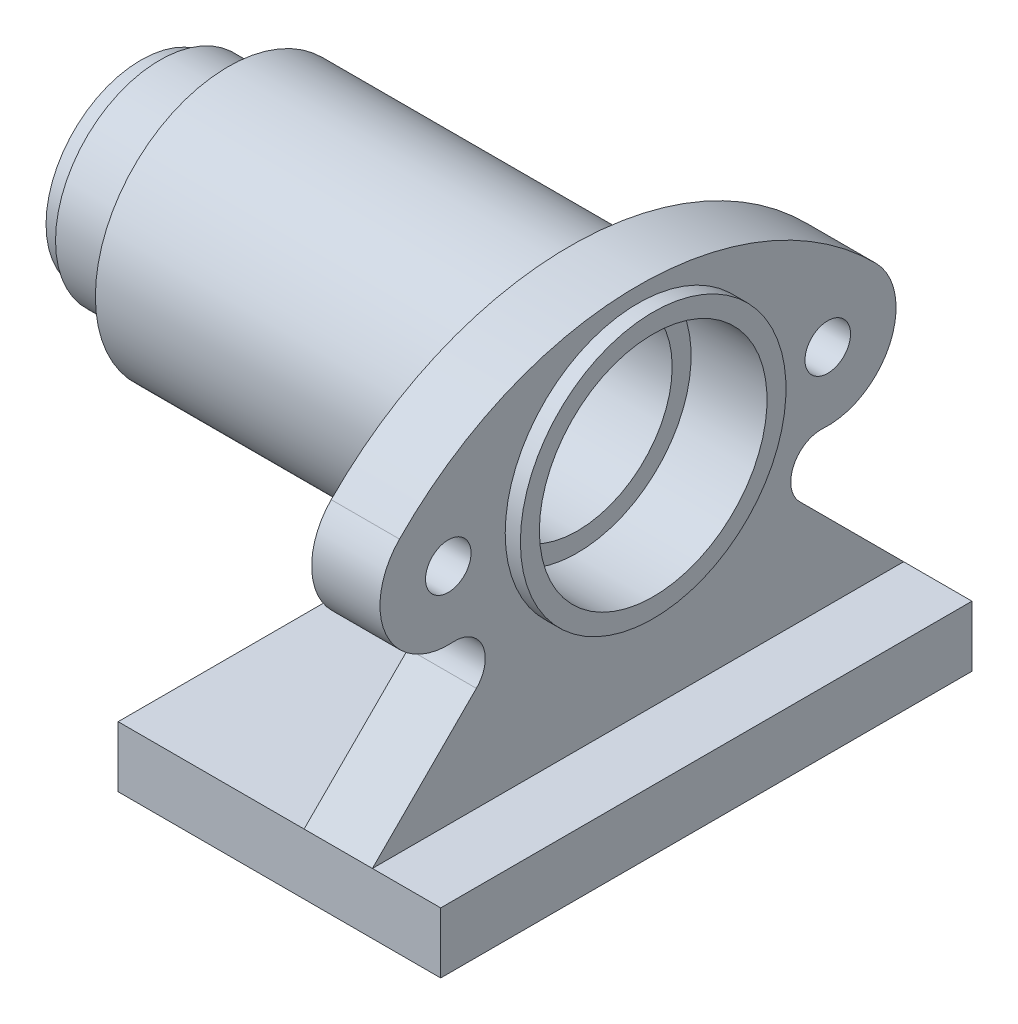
ISO-10303-21;
HEADER;
FILE_DESCRIPTION(('STEP AP214'),'2;1');
FILE_NAME('part.step','',(''),(''),'','','');
FILE_SCHEMA(('AUTOMOTIVE_DESIGN { 1 0 10303 214 1 1 1 1 }'));
ENDSEC;
DATA;
#1=APPLICATION_CONTEXT('core data for automotive mechanical design processes');
#2=APPLICATION_PROTOCOL_DEFINITION('international standard','automotive_design',2000,#1);
#3=PRODUCT_CONTEXT('',#1,'mechanical');
#4=PRODUCT('Part','Part','',(#3));
#5=PRODUCT_RELATED_PRODUCT_CATEGORY('part','',(#4));
#6=PRODUCT_DEFINITION_FORMATION('','',#4);
#7=PRODUCT_DEFINITION_CONTEXT('part definition',#1,'design');
#8=PRODUCT_DEFINITION('design','',#6,#7);
#9=PRODUCT_DEFINITION_SHAPE('','',#8);
#10=(LENGTH_UNIT() NAMED_UNIT(*) SI_UNIT(.MILLI.,.METRE.));
#11=(NAMED_UNIT(*) PLANE_ANGLE_UNIT() SI_UNIT($,.RADIAN.));
#12=(NAMED_UNIT(*) SI_UNIT($,.STERADIAN.) SOLID_ANGLE_UNIT());
#13=UNCERTAINTY_MEASURE_WITH_UNIT(LENGTH_MEASURE(1.E-05),#10,'distance_accuracy_value','');
#14=(GEOMETRIC_REPRESENTATION_CONTEXT(3) GLOBAL_UNCERTAINTY_ASSIGNED_CONTEXT((#13)) GLOBAL_UNIT_ASSIGNED_CONTEXT((#10,
#11,#12)) REPRESENTATION_CONTEXT('',''));
#15=CARTESIAN_POINT('',(0.,0.,0.));
#16=DIRECTION('',(0.,0.,1.));
#17=DIRECTION('',(1.,0.,0.));
#18=AXIS2_PLACEMENT_3D('',#15,#16,#17);
#19=CARTESIAN_POINT('',(0.,16.,70.));
#20=DIRECTION('',(0.,-1.,0.));
#21=DIRECTION('',(1.,0.,0.));
#22=AXIS2_PLACEMENT_3D('',#19,#20,#21);
#23=PLANE('',#22);
#24=DIRECTION('',(0.,0.,-1.));
#25=VECTOR('',#24,1.);
#26=CARTESIAN_POINT('',(-18.,16.,70.));
#27=LINE('',#26,#25);
#28=CARTESIAN_POINT('',(-18.,16.,70.));
#29=VERTEX_POINT('',#28);
#30=CARTESIAN_POINT('',(-18.,16.,-70.));
#31=VERTEX_POINT('',#30);
#32=EDGE_CURVE('E177',#29,#31,#27,.T.);
#33=ORIENTED_EDGE('',*,*,#32,.F.);
#34=DIRECTION('',(-1.,0.,0.));
#35=VECTOR('',#34,1.);
#36=CARTESIAN_POINT('',(0.,16.,70.));
#37=LINE('',#36,#35);
#38=CARTESIAN_POINT('',(0.,16.,70.));
#39=VERTEX_POINT('',#38);
#40=EDGE_CURVE('E218',#39,#29,#37,.T.);
#41=ORIENTED_EDGE('',*,*,#40,.F.);
#42=DIRECTION('',(0.,0.,-1.));
#43=VECTOR('',#42,1.);
#44=CARTESIAN_POINT('',(0.,16.,70.));
#45=LINE('',#44,#43);
#46=CARTESIAN_POINT('',(0.,16.,-70.));
#47=VERTEX_POINT('',#46);
#48=EDGE_CURVE('E42',#39,#47,#45,.T.);
#49=ORIENTED_EDGE('',*,*,#48,.T.);
#50=DIRECTION('',(-1.,0.,0.));
#51=VECTOR('',#50,1.);
#52=CARTESIAN_POINT('',(0.,16.,-70.));
#53=LINE('',#52,#51);
#54=EDGE_CURVE('E224',#47,#31,#53,.T.);
#55=ORIENTED_EDGE('',*,*,#54,.T.);
#56=EDGE_LOOP('',(#33,#41,#49,#55));
#57=FACE_BOUND('',#56,.T.);
#58=ADVANCED_FACE('F33',(#57),#23,.F.);
#59=CARTESIAN_POINT('',(-85.,0.,70.));
#60=DIRECTION('',(0.,1.,0.));
#61=DIRECTION('',(-1.,0.,0.));
#62=AXIS2_PLACEMENT_3D('',#59,#60,#61);
#63=PLANE('',#62);
#64=DIRECTION('',(1.,0.,0.));
#65=VECTOR('',#64,1.);
#66=CARTESIAN_POINT('',(-85.,0.,-70.));
#67=LINE('',#66,#65);
#68=CARTESIAN_POINT('',(-85.,0.,-70.));
#69=VERTEX_POINT('',#68);
#70=CARTESIAN_POINT('',(0.,0.,-70.));
#71=VERTEX_POINT('',#70);
#72=EDGE_CURVE('E168',#69,#71,#67,.T.);
#73=ORIENTED_EDGE('',*,*,#72,.T.);
#74=DIRECTION('',(0.,0.,-1.));
#75=VECTOR('',#74,1.);
#76=CARTESIAN_POINT('',(0.,0.,70.));
#77=LINE('',#76,#75);
#78=CARTESIAN_POINT('',(0.,0.,70.));
#79=VERTEX_POINT('',#78);
#80=EDGE_CURVE('E11',#79,#71,#77,.T.);
#81=ORIENTED_EDGE('',*,*,#80,.F.);
#82=DIRECTION('',(1.,0.,0.));
#83=VECTOR('',#82,1.);
#84=CARTESIAN_POINT('',(-85.,0.,70.));
#85=LINE('',#84,#83);
#86=CARTESIAN_POINT('',(-85.,0.,70.));
#87=VERTEX_POINT('',#86);
#88=EDGE_CURVE('E209',#87,#79,#85,.T.);
#89=ORIENTED_EDGE('',*,*,#88,.F.);
#90=DIRECTION('',(0.,0.,-1.));
#91=VECTOR('',#90,1.);
#92=CARTESIAN_POINT('',(-85.,0.,70.));
#93=LINE('',#92,#91);
#94=EDGE_CURVE('E231',#87,#69,#93,.T.);
#95=ORIENTED_EDGE('',*,*,#94,.T.);
#96=EDGE_LOOP('',(#73,#81,#89,#95));
#97=FACE_BOUND('',#96,.T.);
#98=ADVANCED_FACE('F35',(#97),#63,.F.);
#99=CARTESIAN_POINT('',(0.,0.,70.));
#100=DIRECTION('',(-1.,0.,0.));
#101=DIRECTION('',(0.,-1.,0.));
#102=AXIS2_PLACEMENT_3D('',#99,#100,#101);
#103=PLANE('',#102);
#104=DIRECTION('',(0.,1.,0.));
#105=VECTOR('',#104,1.);
#106=CARTESIAN_POINT('',(0.,0.,-70.));
#107=LINE('',#106,#105);
#108=EDGE_CURVE('E225',#71,#47,#107,.T.);
#109=ORIENTED_EDGE('',*,*,#108,.T.);
#110=ORIENTED_EDGE('',*,*,#48,.F.);
#111=DIRECTION('',(0.,1.,0.));
#112=VECTOR('',#111,1.);
#113=CARTESIAN_POINT('',(0.,0.,70.));
#114=LINE('',#113,#112);
#115=EDGE_CURVE('E87',#79,#39,#114,.T.);
#116=ORIENTED_EDGE('',*,*,#115,.F.);
#117=ORIENTED_EDGE('',*,*,#80,.T.);
#118=EDGE_LOOP('',(#109,#110,#116,#117));
#119=FACE_BOUND('',#118,.T.);
#120=ADVANCED_FACE('F409',(#119),#103,.F.);
#121=CARTESIAN_POINT('',(-36.,16.,70.));
#122=VERTEX_POINT('',#121);
#123=CARTESIAN_POINT('',(-85.,16.,70.));
#124=VERTEX_POINT('',#123);
#125=EDGE_CURVE('E212',#122,#124,#37,.T.);
#126=ORIENTED_EDGE('',*,*,#125,.F.);
#127=DIRECTION('',(0.,0.,-1.));
#128=VECTOR('',#127,1.);
#129=CARTESIAN_POINT('',(-36.,16.,70.));
#130=LINE('',#129,#128);
#131=CARTESIAN_POINT('',(-36.,16.,-70.));
#132=VERTEX_POINT('',#131);
#133=EDGE_CURVE('E153',#122,#132,#130,.T.);
#134=ORIENTED_EDGE('',*,*,#133,.T.);
#135=CARTESIAN_POINT('',(-85.,16.,-70.));
#136=VERTEX_POINT('',#135);
#137=EDGE_CURVE('E221',#132,#136,#53,.T.);
#138=ORIENTED_EDGE('',*,*,#137,.T.);
#139=DIRECTION('',(0.,0.,-1.));
#140=VECTOR('',#139,1.);
#141=CARTESIAN_POINT('',(-85.,16.,70.));
#142=LINE('',#141,#140);
#143=EDGE_CURVE('E233',#124,#136,#142,.T.);
#144=ORIENTED_EDGE('',*,*,#143,.F.);
#145=EDGE_LOOP('',(#126,#134,#138,#144));
#146=FACE_BOUND('',#145,.T.);
#147=ADVANCED_FACE('F248',(#146),#23,.F.);
#148=CARTESIAN_POINT('',(-85.,16.,70.));
#149=DIRECTION('',(1.,0.,0.));
#150=DIRECTION('',(0.,0.,-1.));
#151=AXIS2_PLACEMENT_3D('',#148,#149,#150);
#152=PLANE('',#151);
#153=DIRECTION('',(0.,-1.,0.));
#154=VECTOR('',#153,1.);
#155=CARTESIAN_POINT('',(-85.,16.,-70.));
#156=LINE('',#155,#154);
#157=EDGE_CURVE('E80',#136,#69,#156,.T.);
#158=ORIENTED_EDGE('',*,*,#157,.T.);
#159=ORIENTED_EDGE('',*,*,#94,.F.);
#160=DIRECTION('',(0.,-1.,0.));
#161=VECTOR('',#160,1.);
#162=CARTESIAN_POINT('',(-85.,16.,70.));
#163=LINE('',#162,#161);
#164=EDGE_CURVE('E59',#124,#87,#163,.T.);
#165=ORIENTED_EDGE('',*,*,#164,.F.);
#166=ORIENTED_EDGE('',*,*,#143,.T.);
#167=EDGE_LOOP('',(#158,#159,#165,#166));
#168=FACE_BOUND('',#167,.T.);
#169=ADVANCED_FACE('F249',(#168),#152,.F.);
#170=CARTESIAN_POINT('',(0.,0.,70.));
#171=DIRECTION('',(0.,0.,1.));
#172=DIRECTION('',(1.,0.,0.));
#173=AXIS2_PLACEMENT_3D('',#170,#171,#172);
#174=PLANE('',#173);
#175=ORIENTED_EDGE('',*,*,#88,.T.);
#176=ORIENTED_EDGE('',*,*,#115,.T.);
#177=ORIENTED_EDGE('',*,*,#40,.T.);
#178=DIRECTION('',(1.,0.,0.));
#179=VECTOR('',#178,1.);
#180=CARTESIAN_POINT('',(-36.,16.,70.));
#181=LINE('',#180,#179);
#182=EDGE_CURVE('E166',#122,#29,#181,.T.);
#183=ORIENTED_EDGE('',*,*,#182,.F.);
#184=ORIENTED_EDGE('',*,*,#125,.T.);
#185=ORIENTED_EDGE('',*,*,#164,.T.);
#186=EDGE_LOOP('',(#175,#176,#177,#183,#184,#185));
#187=FACE_BOUND('',#186,.T.);
#188=ADVANCED_FACE('F254',(#187),#174,.T.);
#189=CARTESIAN_POINT('',(0.,0.,-70.));
#190=DIRECTION('',(0.,0.,1.));
#191=DIRECTION('',(1.,0.,0.));
#192=AXIS2_PLACEMENT_3D('',#189,#190,#191);
#193=PLANE('',#192);
#194=ORIENTED_EDGE('',*,*,#72,.F.);
#195=ORIENTED_EDGE('',*,*,#157,.F.);
#196=ORIENTED_EDGE('',*,*,#137,.F.);
#197=DIRECTION('',(1.,0.,0.));
#198=VECTOR('',#197,1.);
#199=CARTESIAN_POINT('',(-36.,16.,-70.));
#200=LINE('',#199,#198);
#201=EDGE_CURVE('E142',#132,#31,#200,.T.);
#202=ORIENTED_EDGE('',*,*,#201,.T.);
#203=ORIENTED_EDGE('',*,*,#54,.F.);
#204=ORIENTED_EDGE('',*,*,#108,.F.);
#205=EDGE_LOOP('',(#194,#195,#196,#202,#203,#204));
#206=FACE_BOUND('',#205,.T.);
#207=ADVANCED_FACE('F243',(#206),#193,.F.);
#208=CARTESIAN_POINT('',(-36.,16.,70.));
#209=DIRECTION('',(0.,0.707106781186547,0.707106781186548));
#210=DIRECTION('',(0.,-0.707106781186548,0.707106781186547));
#211=AXIS2_PLACEMENT_3D('',#208,#209,#210);
#212=PLANE('',#211);
#213=DIRECTION('',(0.,-0.707106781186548,0.707106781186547));
#214=VECTOR('',#213,1.);
#215=CARTESIAN_POINT('',(-18.,16.,70.));
#216=LINE('',#215,#214);
#217=CARTESIAN_POINT('',(-18.,43.4017639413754,42.5982360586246));
#218=VERTEX_POINT('',#217);
#219=EDGE_CURVE('E155',#218,#29,#216,.T.);
#220=ORIENTED_EDGE('',*,*,#219,.F.);
#221=DIRECTION('',(1.,0.,0.));
#222=VECTOR('',#221,1.);
#223=CARTESIAN_POINT('',(-36.,43.4017639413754,42.5982360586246));
#224=LINE('',#223,#222);
#225=CARTESIAN_POINT('',(-36.,43.4017639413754,42.5982360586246));
#226=VERTEX_POINT('',#225);
#227=EDGE_CURVE('E169',#226,#218,#224,.T.);
#228=ORIENTED_EDGE('',*,*,#227,.F.);
#229=DIRECTION('',(0.,-0.707106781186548,0.707106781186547));
#230=VECTOR('',#229,1.);
#231=CARTESIAN_POINT('',(-36.,16.,70.));
#232=LINE('',#231,#230);
#233=EDGE_CURVE('E163',#226,#122,#232,.T.);
#234=ORIENTED_EDGE('',*,*,#233,.T.);
#235=ORIENTED_EDGE('',*,*,#182,.T.);
#236=EDGE_LOOP('',(#220,#228,#234,#235));
#237=FACE_BOUND('',#236,.T.);
#238=ADVANCED_FACE('F259',(#237),#212,.T.);
#239=CARTESIAN_POINT('',(-36.,49.0586181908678,48.255090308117));
#240=DIRECTION('',(1.,0.,0.));
#241=DIRECTION('',(0.,0.,-1.));
#242=AXIS2_PLACEMENT_3D('',#239,#240,#241);
#243=CYLINDRICAL_SURFACE('',#242,8.);
#244=CARTESIAN_POINT('',(-18.,49.0586181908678,48.255090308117));
#245=DIRECTION('',(-1.,0.,0.));
#246=DIRECTION('',(0.,0.,-1.));
#247=AXIS2_PLACEMENT_3D('',#244,#245,#246);
#248=CIRCLE('',#247,8.);
#249=CARTESIAN_POINT('',(-18.,57.0405818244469,48.7919855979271));
#250=VERTEX_POINT('',#249);
#251=EDGE_CURVE('E198',#250,#218,#248,.T.);
#252=ORIENTED_EDGE('',*,*,#251,.F.);
#253=DIRECTION('',(1.,0.,0.));
#254=VECTOR('',#253,1.);
#255=CARTESIAN_POINT('',(-36.,57.0405818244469,48.7919855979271));
#256=LINE('',#255,#254);
#257=CARTESIAN_POINT('',(-36.,57.0405818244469,48.7919855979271));
#258=VERTEX_POINT('',#257);
#259=EDGE_CURVE('E202',#258,#250,#256,.T.);
#260=ORIENTED_EDGE('',*,*,#259,.F.);
#261=CARTESIAN_POINT('',(-36.,49.0586181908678,48.255090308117));
#262=DIRECTION('',(-1.,0.,0.));
#263=DIRECTION('',(0.,0.,-1.));
#264=AXIS2_PLACEMENT_3D('',#261,#262,#263);
#265=CIRCLE('',#264,8.);
#266=EDGE_CURVE('E174',#258,#226,#265,.T.);
#267=ORIENTED_EDGE('',*,*,#266,.T.);
#268=ORIENTED_EDGE('',*,*,#227,.T.);
#269=EDGE_LOOP('',(#252,#260,#267,#268));
#270=FACE_BOUND('',#269,.T.);
#271=ADVANCED_FACE('F266',(#270),#243,.F.);
#272=CARTESIAN_POINT('',(-36.,75.,50.));
#273=DIRECTION('',(1.,0.,0.));
#274=DIRECTION('',(0.,0.,-1.));
#275=AXIS2_PLACEMENT_3D('',#272,#273,#274);
#276=CYLINDRICAL_SURFACE('',#275,18.);
#277=CARTESIAN_POINT('',(-18.,75.,50.));
#278=DIRECTION('',(1.,0.,0.));
#279=DIRECTION('',(0.,0.,1.));
#280=AXIS2_PLACEMENT_3D('',#277,#278,#279);
#281=CIRCLE('',#280,18.);
#282=CARTESIAN_POINT('',(-18.,87.5973758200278,62.8571428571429));
#283=VERTEX_POINT('',#282);
#284=EDGE_CURVE('E195',#283,#250,#281,.T.);
#285=ORIENTED_EDGE('',*,*,#284,.F.);
#286=DIRECTION('',(1.,0.,0.));
#287=VECTOR('',#286,1.);
#288=CARTESIAN_POINT('',(-36.,87.5973758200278,62.8571428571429));
#289=LINE('',#288,#287);
#290=CARTESIAN_POINT('',(-36.,87.5973758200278,62.8571428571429));
#291=VERTEX_POINT('',#290);
#292=EDGE_CURVE('E204',#291,#283,#289,.T.);
#293=ORIENTED_EDGE('',*,*,#292,.F.);
#294=CARTESIAN_POINT('',(-36.,75.,50.));
#295=DIRECTION('',(1.,0.,0.));
#296=DIRECTION('',(0.,0.,1.));
#297=AXIS2_PLACEMENT_3D('',#294,#295,#296);
#298=CIRCLE('',#297,18.);
#299=EDGE_CURVE('E271',#291,#258,#298,.T.);
#300=ORIENTED_EDGE('',*,*,#299,.T.);
#301=ORIENTED_EDGE('',*,*,#259,.T.);
#302=EDGE_LOOP('',(#285,#293,#300,#301));
#303=FACE_BOUND('',#302,.T.);
#304=ADVANCED_FACE('F536',(#303),#276,.T.);
#305=CARTESIAN_POINT('',(-36.,26.0102051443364,0.));
#306=DIRECTION('',(1.,0.,0.));
#307=DIRECTION('',(0.,0.,-1.));
#308=AXIS2_PLACEMENT_3D('',#305,#306,#307);
#309=CYLINDRICAL_SURFACE('',#308,88.);
#310=CARTESIAN_POINT('',(-18.,26.0102051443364,0.));
#311=DIRECTION('',(1.,0.,0.));
#312=DIRECTION('',(0.,0.,1.));
#313=AXIS2_PLACEMENT_3D('',#310,#311,#312);
#314=CIRCLE('',#313,88.);
#315=CARTESIAN_POINT('',(-18.,87.5973758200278,-62.8571428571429));
#316=VERTEX_POINT('',#315);
#317=EDGE_CURVE('E192',#316,#283,#314,.T.);
#318=ORIENTED_EDGE('',*,*,#317,.F.);
#319=DIRECTION('',(1.,0.,0.));
#320=VECTOR('',#319,1.);
#321=CARTESIAN_POINT('',(-36.,87.5973758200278,-62.8571428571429));
#322=LINE('',#321,#320);
#323=CARTESIAN_POINT('',(-36.,87.5973758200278,-62.8571428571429));
#324=VERTEX_POINT('',#323);
#325=EDGE_CURVE('E206',#324,#316,#322,.T.);
#326=ORIENTED_EDGE('',*,*,#325,.F.);
#327=CARTESIAN_POINT('',(-36.,26.0102051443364,0.));
#328=DIRECTION('',(1.,0.,0.));
#329=DIRECTION('',(0.,0.,1.));
#330=AXIS2_PLACEMENT_3D('',#327,#328,#329);
#331=CIRCLE('',#330,88.);
#332=EDGE_CURVE('E272',#324,#291,#331,.T.);
#333=ORIENTED_EDGE('',*,*,#332,.T.);
#334=ORIENTED_EDGE('',*,*,#292,.T.);
#335=EDGE_LOOP('',(#318,#326,#333,#334));
#336=FACE_BOUND('',#335,.T.);
#337=ADVANCED_FACE('F544',(#336),#309,.T.);
#338=CARTESIAN_POINT('',(-36.,75.,-50.));
#339=DIRECTION('',(1.,0.,0.));
#340=DIRECTION('',(0.,0.,-1.));
#341=AXIS2_PLACEMENT_3D('',#338,#339,#340);
#342=CYLINDRICAL_SURFACE('',#341,18.);
#343=CARTESIAN_POINT('',(-18.,75.,-50.));
#344=DIRECTION('',(1.,0.,0.));
#345=DIRECTION('',(0.,0.,-1.));
#346=AXIS2_PLACEMENT_3D('',#343,#344,#345);
#347=CIRCLE('',#346,18.);
#348=CARTESIAN_POINT('',(-18.,57.0405818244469,-48.7919855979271));
#349=VERTEX_POINT('',#348);
#350=EDGE_CURVE('E189',#349,#316,#347,.T.);
#351=ORIENTED_EDGE('',*,*,#350,.F.);
#352=DIRECTION('',(1.,0.,0.));
#353=VECTOR('',#352,1.);
#354=CARTESIAN_POINT('',(-36.,57.0405818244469,-48.7919855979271));
#355=LINE('',#354,#353);
#356=CARTESIAN_POINT('',(-36.,57.0405818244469,-48.7919855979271));
#357=VERTEX_POINT('',#356);
#358=EDGE_CURVE('E141',#357,#349,#355,.T.);
#359=ORIENTED_EDGE('',*,*,#358,.F.);
#360=CARTESIAN_POINT('',(-36.,75.,-50.));
#361=DIRECTION('',(1.,0.,0.));
#362=DIRECTION('',(0.,0.,-1.));
#363=AXIS2_PLACEMENT_3D('',#360,#361,#362);
#364=CIRCLE('',#363,18.);
#365=EDGE_CURVE('E148',#357,#324,#364,.T.);
#366=ORIENTED_EDGE('',*,*,#365,.T.);
#367=ORIENTED_EDGE('',*,*,#325,.T.);
#368=EDGE_LOOP('',(#351,#359,#366,#367));
#369=FACE_BOUND('',#368,.T.);
#370=ADVANCED_FACE('F552',(#369),#342,.T.);
#371=CARTESIAN_POINT('',(-36.,49.0586181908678,-48.255090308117));
#372=DIRECTION('',(1.,0.,0.));
#373=DIRECTION('',(0.,0.,-1.));
#374=AXIS2_PLACEMENT_3D('',#371,#372,#373);
#375=CYLINDRICAL_SURFACE('',#374,8.);
#376=CARTESIAN_POINT('',(-18.,49.0586181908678,-48.255090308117));
#377=DIRECTION('',(-1.,0.,0.));
#378=DIRECTION('',(0.,0.,1.));
#379=AXIS2_PLACEMENT_3D('',#376,#377,#378);
#380=CIRCLE('',#379,8.);
#381=CARTESIAN_POINT('',(-18.,43.4017639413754,-42.5982360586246));
#382=VERTEX_POINT('',#381);
#383=EDGE_CURVE('E138',#382,#349,#380,.T.);
#384=ORIENTED_EDGE('',*,*,#383,.F.);
#385=DIRECTION('',(1.,0.,0.));
#386=VECTOR('',#385,1.);
#387=CARTESIAN_POINT('',(-36.,43.4017639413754,-42.5982360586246));
#388=LINE('',#387,#386);
#389=CARTESIAN_POINT('',(-36.,43.4017639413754,-42.5982360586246));
#390=VERTEX_POINT('',#389);
#391=EDGE_CURVE('E134',#390,#382,#388,.T.);
#392=ORIENTED_EDGE('',*,*,#391,.F.);
#393=CARTESIAN_POINT('',(-36.,49.0586181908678,-48.255090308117));
#394=DIRECTION('',(-1.,0.,0.));
#395=DIRECTION('',(0.,0.,1.));
#396=AXIS2_PLACEMENT_3D('',#393,#394,#395);
#397=CIRCLE('',#396,8.);
#398=EDGE_CURVE('E136',#390,#357,#397,.T.);
#399=ORIENTED_EDGE('',*,*,#398,.T.);
#400=ORIENTED_EDGE('',*,*,#358,.T.);
#401=EDGE_LOOP('',(#384,#392,#399,#400));
#402=FACE_BOUND('',#401,.T.);
#403=ADVANCED_FACE('F135',(#402),#375,.F.);
#404=CARTESIAN_POINT('',(-36.,16.,-70.));
#405=DIRECTION('',(0.,0.707106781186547,-0.707106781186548));
#406=DIRECTION('',(0.,0.707106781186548,0.707106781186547));
#407=AXIS2_PLACEMENT_3D('',#404,#405,#406);
#408=PLANE('',#407);
#409=DIRECTION('',(0.,0.707106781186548,0.707106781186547));
#410=VECTOR('',#409,1.);
#411=CARTESIAN_POINT('',(-18.,16.,-70.));
#412=LINE('',#411,#410);
#413=EDGE_CURVE('E181',#31,#382,#412,.T.);
#414=ORIENTED_EDGE('',*,*,#413,.F.);
#415=ORIENTED_EDGE('',*,*,#201,.F.);
#416=DIRECTION('',(0.,0.707106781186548,0.707106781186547));
#417=VECTOR('',#416,1.);
#418=CARTESIAN_POINT('',(-36.,16.,-70.));
#419=LINE('',#418,#417);
#420=EDGE_CURVE('E50',#132,#390,#419,.T.);
#421=ORIENTED_EDGE('',*,*,#420,.T.);
#422=ORIENTED_EDGE('',*,*,#391,.T.);
#423=EDGE_LOOP('',(#414,#415,#421,#422));
#424=FACE_BOUND('',#423,.T.);
#425=ADVANCED_FACE('F150',(#424),#408,.T.);
#426=CARTESIAN_POINT('',(-36.,49.0586181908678,-48.255090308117));
#427=DIRECTION('',(-1.,0.,0.));
#428=DIRECTION('',(0.,0.,1.));
#429=AXIS2_PLACEMENT_3D('',#426,#427,#428);
#430=PLANE('',#429);
#431=CARTESIAN_POINT('',(-36.,75.,0.));
#432=DIRECTION('',(-1.,0.,0.));
#433=DIRECTION('',(0.,0.,1.));
#434=AXIS2_PLACEMENT_3D('',#431,#432,#433);
#435=CIRCLE('',#434,35.);
#436=CARTESIAN_POINT('',(-36.,75.,35.));
#437=VERTEX_POINT('',#436);
#438=EDGE_CURVE('E293',#437,#437,#435,.F.);
#439=ORIENTED_EDGE('',*,*,#438,.T.);
#440=EDGE_LOOP('',(#439));
#441=FACE_BOUND('',#440,.T.);
#442=CARTESIAN_POINT('',(-36.,75.,-50.));
#443=DIRECTION('',(1.,0.,0.));
#444=DIRECTION('',(0.,0.,1.));
#445=AXIS2_PLACEMENT_3D('',#442,#443,#444);
#446=CIRCLE('',#445,6.);
#447=CARTESIAN_POINT('',(-36.,75.,-44.));
#448=VERTEX_POINT('',#447);
#449=EDGE_CURVE('E282',#448,#448,#446,.T.);
#450=ORIENTED_EDGE('',*,*,#449,.T.);
#451=EDGE_LOOP('',(#450));
#452=FACE_BOUND('',#451,.T.);
#453=CARTESIAN_POINT('',(-36.,75.,50.));
#454=DIRECTION('',(1.,0.,0.));
#455=DIRECTION('',(0.,0.,-1.));
#456=AXIS2_PLACEMENT_3D('',#453,#454,#455);
#457=CIRCLE('',#456,6.);
#458=CARTESIAN_POINT('',(-36.,75.,44.));
#459=VERTEX_POINT('',#458);
#460=EDGE_CURVE('E182',#459,#459,#457,.T.);
#461=ORIENTED_EDGE('',*,*,#460,.T.);
#462=EDGE_LOOP('',(#461));
#463=FACE_BOUND('',#462,.T.);
#464=ORIENTED_EDGE('',*,*,#133,.F.);
#465=ORIENTED_EDGE('',*,*,#233,.F.);
#466=ORIENTED_EDGE('',*,*,#266,.F.);
#467=ORIENTED_EDGE('',*,*,#299,.F.);
#468=ORIENTED_EDGE('',*,*,#332,.F.);
#469=ORIENTED_EDGE('',*,*,#365,.F.);
#470=ORIENTED_EDGE('',*,*,#398,.F.);
#471=ORIENTED_EDGE('',*,*,#420,.F.);
#472=EDGE_LOOP('',(#464,#465,#466,#467,#468,#469,#470,#471));
#473=FACE_BOUND('',#472,.T.);
#474=ADVANCED_FACE('F145',(#441,#452,#463,#473),#430,.T.);
#475=CARTESIAN_POINT('',(-18.,49.0586181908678,-48.255090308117));
#476=DIRECTION('',(-1.,0.,0.));
#477=DIRECTION('',(0.,0.,1.));
#478=AXIS2_PLACEMENT_3D('',#475,#476,#477);
#479=PLANE('',#478);
#480=CARTESIAN_POINT('',(-18.,75.,0.));
#481=DIRECTION('',(1.,0.,0.));
#482=DIRECTION('',(0.,0.,-1.));
#483=AXIS2_PLACEMENT_3D('',#480,#481,#482);
#484=CIRCLE('',#483,35.);
#485=CARTESIAN_POINT('',(-18.,75.,-35.));
#486=VERTEX_POINT('',#485);
#487=EDGE_CURVE('E288',#486,#486,#484,.T.);
#488=ORIENTED_EDGE('',*,*,#487,.F.);
#489=EDGE_LOOP('',(#488));
#490=FACE_BOUND('',#489,.T.);
#491=CARTESIAN_POINT('',(-18.,75.,-50.));
#492=DIRECTION('',(1.,0.,0.));
#493=DIRECTION('',(0.,0.,1.));
#494=AXIS2_PLACEMENT_3D('',#491,#492,#493);
#495=CIRCLE('',#494,6.);
#496=CARTESIAN_POINT('',(-18.,75.,-44.));
#497=VERTEX_POINT('',#496);
#498=EDGE_CURVE('E285',#497,#497,#495,.T.);
#499=ORIENTED_EDGE('',*,*,#498,.F.);
#500=EDGE_LOOP('',(#499));
#501=FACE_BOUND('',#500,.T.);
#502=CARTESIAN_POINT('',(-18.,75.,50.));
#503=DIRECTION('',(1.,0.,0.));
#504=DIRECTION('',(0.,0.,-1.));
#505=AXIS2_PLACEMENT_3D('',#502,#503,#504);
#506=CIRCLE('',#505,6.);
#507=CARTESIAN_POINT('',(-18.,75.,44.));
#508=VERTEX_POINT('',#507);
#509=EDGE_CURVE('E279',#508,#508,#506,.T.);
#510=ORIENTED_EDGE('',*,*,#509,.F.);
#511=EDGE_LOOP('',(#510));
#512=FACE_BOUND('',#511,.T.);
#513=ORIENTED_EDGE('',*,*,#32,.T.);
#514=ORIENTED_EDGE('',*,*,#413,.T.);
#515=ORIENTED_EDGE('',*,*,#383,.T.);
#516=ORIENTED_EDGE('',*,*,#350,.T.);
#517=ORIENTED_EDGE('',*,*,#317,.T.);
#518=ORIENTED_EDGE('',*,*,#284,.T.);
#519=ORIENTED_EDGE('',*,*,#251,.T.);
#520=ORIENTED_EDGE('',*,*,#219,.T.);
#521=EDGE_LOOP('',(#513,#514,#515,#516,#517,#518,#519,#520));
#522=FACE_BOUND('',#521,.T.);
#523=ADVANCED_FACE('F262',(#490,#501,#512,#522),#479,.F.);
#524=CARTESIAN_POINT('',(-36.,75.,50.));
#525=DIRECTION('',(1.,0.,0.));
#526=DIRECTION('',(0.,0.,-1.));
#527=AXIS2_PLACEMENT_3D('',#524,#525,#526);
#528=CYLINDRICAL_SURFACE('',#527,6.);
#529=ORIENTED_EDGE('',*,*,#460,.F.);
#530=EDGE_LOOP('',(#529));
#531=FACE_BOUND('',#530,.T.);
#532=ORIENTED_EDGE('',*,*,#509,.T.);
#533=EDGE_LOOP('',(#532));
#534=FACE_BOUND('',#533,.T.);
#535=ADVANCED_FACE('F591',(#531,#534),#528,.F.);
#536=CARTESIAN_POINT('',(-36.,75.,-50.));
#537=DIRECTION('',(1.,0.,0.));
#538=DIRECTION('',(0.,0.,-1.));
#539=AXIS2_PLACEMENT_3D('',#536,#537,#538);
#540=CYLINDRICAL_SURFACE('',#539,6.);
#541=ORIENTED_EDGE('',*,*,#449,.F.);
#542=EDGE_LOOP('',(#541));
#543=FACE_BOUND('',#542,.T.);
#544=ORIENTED_EDGE('',*,*,#498,.T.);
#545=EDGE_LOOP('',(#544));
#546=FACE_BOUND('',#545,.T.);
#547=ADVANCED_FACE('F402',(#543,#546),#540,.F.);
#548=CARTESIAN_POINT('',(-107.067924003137,75.,0.));
#549=DIRECTION('',(-1.,0.,0.));
#550=DIRECTION('',(0.,0.,1.));
#551=AXIS2_PLACEMENT_3D('',#548,#549,#550);
#552=CYLINDRICAL_SURFACE('',#551,35.);
#553=CARTESIAN_POINT('',(-14.,75.,0.));
#554=DIRECTION('',(-1.,0.,0.));
#555=DIRECTION('',(0.,0.,1.));
#556=AXIS2_PLACEMENT_3D('',#553,#554,#555);
#557=CIRCLE('',#556,35.);
#558=CARTESIAN_POINT('',(-14.,75.,35.));
#559=VERTEX_POINT('',#558);
#560=EDGE_CURVE('E323',#559,#559,#557,.T.);
#561=ORIENTED_EDGE('',*,*,#560,.T.);
#562=EDGE_LOOP('',(#561));
#563=FACE_BOUND('',#562,.T.);
#564=ORIENTED_EDGE('',*,*,#487,.T.);
#565=EDGE_LOOP('',(#564));
#566=FACE_BOUND('',#565,.T.);
#567=ADVANCED_FACE('F339',(#563,#566),#552,.T.);
#568=CARTESIAN_POINT('',(-34.,100.,0.));
#569=DIRECTION('',(-1.,0.,0.));
#570=DIRECTION('',(0.,0.,1.));
#571=AXIS2_PLACEMENT_3D('',#568,#569,#570);
#572=PLANE('',#571);
#573=CARTESIAN_POINT('',(-34.,75.,0.));
#574=DIRECTION('',(-1.,0.,0.));
#575=DIRECTION('',(0.,0.,1.));
#576=AXIS2_PLACEMENT_3D('',#573,#574,#575);
#577=CIRCLE('',#576,30.);
#578=CARTESIAN_POINT('',(-34.,75.,30.));
#579=VERTEX_POINT('',#578);
#580=EDGE_CURVE('E329',#579,#579,#577,.T.);
#581=ORIENTED_EDGE('',*,*,#580,.F.);
#582=EDGE_LOOP('',(#581));
#583=FACE_BOUND('',#582,.T.);
#584=CARTESIAN_POINT('',(-34.,75.,0.));
#585=DIRECTION('',(-1.,0.,0.));
#586=DIRECTION('',(0.,0.,1.));
#587=AXIS2_PLACEMENT_3D('',#584,#585,#586);
#588=CIRCLE('',#587,25.);
#589=CARTESIAN_POINT('',(-34.,75.,25.));
#590=VERTEX_POINT('',#589);
#591=EDGE_CURVE('E296',#590,#590,#588,.T.);
#592=ORIENTED_EDGE('',*,*,#591,.T.);
#593=EDGE_LOOP('',(#592));
#594=FACE_BOUND('',#593,.T.);
#595=ADVANCED_FACE('F335',(#583,#594),#572,.F.);
#596=CARTESIAN_POINT('',(-107.067924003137,75.,0.));
#597=DIRECTION('',(-1.,0.,0.));
#598=DIRECTION('',(0.,0.,1.));
#599=AXIS2_PLACEMENT_3D('',#596,#597,#598);
#600=CYLINDRICAL_SURFACE('',#599,25.);
#601=ORIENTED_EDGE('',*,*,#591,.F.);
#602=EDGE_LOOP('',(#601));
#603=FACE_BOUND('',#602,.T.);
#604=CARTESIAN_POINT('',(-114.,75.,0.));
#605=DIRECTION('',(-1.,0.,0.));
#606=DIRECTION('',(0.,0.,1.));
#607=AXIS2_PLACEMENT_3D('',#604,#605,#606);
#608=CIRCLE('',#607,25.);
#609=CARTESIAN_POINT('',(-114.,75.,25.));
#610=VERTEX_POINT('',#609);
#611=EDGE_CURVE('E299',#610,#610,#608,.T.);
#612=ORIENTED_EDGE('',*,*,#611,.T.);
#613=EDGE_LOOP('',(#612));
#614=FACE_BOUND('',#613,.T.);
#615=ADVANCED_FACE('F338',(#603,#614),#600,.F.);
#616=CARTESIAN_POINT('',(-114.,100.,0.));
#617=DIRECTION('',(-1.,0.,0.));
#618=DIRECTION('',(0.,0.,1.));
#619=AXIS2_PLACEMENT_3D('',#616,#617,#618);
#620=PLANE('',#619);
#621=ORIENTED_EDGE('',*,*,#611,.F.);
#622=EDGE_LOOP('',(#621));
#623=FACE_BOUND('',#622,.T.);
#624=CARTESIAN_POINT('',(-114.,75.,0.));
#625=DIRECTION('',(-1.,0.,0.));
#626=DIRECTION('',(0.,0.,1.));
#627=AXIS2_PLACEMENT_3D('',#624,#625,#626);
#628=CIRCLE('',#627,16.);
#629=CARTESIAN_POINT('',(-114.,75.,16.));
#630=VERTEX_POINT('',#629);
#631=EDGE_CURVE('E302',#630,#630,#628,.T.);
#632=ORIENTED_EDGE('',*,*,#631,.T.);
#633=EDGE_LOOP('',(#632));
#634=FACE_BOUND('',#633,.T.);
#635=ADVANCED_FACE('F345',(#623,#634),#620,.F.);
#636=CARTESIAN_POINT('',(-107.067924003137,75.,0.));
#637=DIRECTION('',(-1.,0.,0.));
#638=DIRECTION('',(0.,0.,1.));
#639=AXIS2_PLACEMENT_3D('',#636,#637,#638);
#640=CYLINDRICAL_SURFACE('',#639,16.);
#641=ORIENTED_EDGE('',*,*,#631,.F.);
#642=EDGE_LOOP('',(#641));
#643=FACE_BOUND('',#642,.T.);
#644=CARTESIAN_POINT('',(-149.,75.,0.));
#645=DIRECTION('',(-1.,0.,0.));
#646=DIRECTION('',(0.,0.,1.));
#647=AXIS2_PLACEMENT_3D('',#644,#645,#646);
#648=CIRCLE('',#647,16.);
#649=CARTESIAN_POINT('',(-149.,75.,16.));
#650=VERTEX_POINT('',#649);
#651=EDGE_CURVE('E305',#650,#650,#648,.T.);
#652=ORIENTED_EDGE('',*,*,#651,.T.);
#653=EDGE_LOOP('',(#652));
#654=FACE_BOUND('',#653,.T.);
#655=ADVANCED_FACE('F351',(#643,#654),#640,.F.);
#656=CARTESIAN_POINT('',(-149.,91.,0.));
#657=DIRECTION('',(1.,0.,0.));
#658=DIRECTION('',(0.,0.,-1.));
#659=AXIS2_PLACEMENT_3D('',#656,#657,#658);
#660=PLANE('',#659);
#661=ORIENTED_EDGE('',*,*,#651,.F.);
#662=EDGE_LOOP('',(#661));
#663=FACE_BOUND('',#662,.T.);
#664=CARTESIAN_POINT('',(-149.,75.,0.));
#665=DIRECTION('',(-1.,0.,0.));
#666=DIRECTION('',(0.,0.,1.));
#667=AXIS2_PLACEMENT_3D('',#664,#665,#666);
#668=CIRCLE('',#667,25.);
#669=CARTESIAN_POINT('',(-149.,75.,25.));
#670=VERTEX_POINT('',#669);
#671=EDGE_CURVE('E308',#670,#670,#668,.T.);
#672=ORIENTED_EDGE('',*,*,#671,.T.);
#673=EDGE_LOOP('',(#672));
#674=FACE_BOUND('',#673,.T.);
#675=ADVANCED_FACE('F357',(#663,#674),#660,.F.);
#676=CARTESIAN_POINT('',(-107.067924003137,75.,0.));
#677=DIRECTION('',(-1.,0.,0.));
#678=DIRECTION('',(0.,0.,1.));
#679=AXIS2_PLACEMENT_3D('',#676,#677,#678);
#680=CYLINDRICAL_SURFACE('',#679,25.);
#681=ORIENTED_EDGE('',*,*,#671,.F.);
#682=EDGE_LOOP('',(#681));
#683=FACE_BOUND('',#682,.T.);
#684=CARTESIAN_POINT('',(-144.,75.,0.));
#685=DIRECTION('',(-1.,0.,0.));
#686=DIRECTION('',(0.,0.,1.));
#687=AXIS2_PLACEMENT_3D('',#684,#685,#686);
#688=CIRCLE('',#687,25.);
#689=CARTESIAN_POINT('',(-144.,75.,25.));
#690=VERTEX_POINT('',#689);
#691=EDGE_CURVE('E311',#690,#690,#688,.T.);
#692=ORIENTED_EDGE('',*,*,#691,.T.);
#693=EDGE_LOOP('',(#692));
#694=FACE_BOUND('',#693,.T.);
#695=ADVANCED_FACE('F363',(#683,#694),#680,.T.);
#696=CARTESIAN_POINT('',(-144.,100.,0.));
#697=DIRECTION('',(1.,0.,0.));
#698=DIRECTION('',(0.,0.,-1.));
#699=AXIS2_PLACEMENT_3D('',#696,#697,#698);
#700=PLANE('',#699);
#701=ORIENTED_EDGE('',*,*,#691,.F.);
#702=EDGE_LOOP('',(#701));
#703=FACE_BOUND('',#702,.T.);
#704=CARTESIAN_POINT('',(-144.,75.,0.));
#705=DIRECTION('',(-1.,0.,0.));
#706=DIRECTION('',(0.,0.,1.));
#707=AXIS2_PLACEMENT_3D('',#704,#705,#706);
#708=CIRCLE('',#707,27.5);
#709=CARTESIAN_POINT('',(-144.,75.,27.5));
#710=VERTEX_POINT('',#709);
#711=EDGE_CURVE('E314',#710,#710,#708,.T.);
#712=ORIENTED_EDGE('',*,*,#711,.T.);
#713=EDGE_LOOP('',(#712));
#714=FACE_BOUND('',#713,.T.);
#715=ADVANCED_FACE('F369',(#703,#714),#700,.F.);
#716=CARTESIAN_POINT('',(-107.067924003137,75.,0.));
#717=DIRECTION('',(-1.,0.,0.));
#718=DIRECTION('',(0.,0.,1.));
#719=AXIS2_PLACEMENT_3D('',#716,#717,#718);
#720=CYLINDRICAL_SURFACE('',#719,27.5);
#721=ORIENTED_EDGE('',*,*,#711,.F.);
#722=EDGE_LOOP('',(#721));
#723=FACE_BOUND('',#722,.T.);
#724=CARTESIAN_POINT('',(-126.,75.,0.));
#725=DIRECTION('',(-1.,0.,0.));
#726=DIRECTION('',(0.,0.,1.));
#727=AXIS2_PLACEMENT_3D('',#724,#725,#726);
#728=CIRCLE('',#727,27.5);
#729=CARTESIAN_POINT('',(-126.,75.,27.5));
#730=VERTEX_POINT('',#729);
#731=EDGE_CURVE('E317',#730,#730,#728,.T.);
#732=ORIENTED_EDGE('',*,*,#731,.T.);
#733=EDGE_LOOP('',(#732));
#734=FACE_BOUND('',#733,.T.);
#735=ADVANCED_FACE('F375',(#723,#734),#720,.T.);
#736=CARTESIAN_POINT('',(-126.,102.5,0.));
#737=DIRECTION('',(1.,0.,0.));
#738=DIRECTION('',(0.,0.,-1.));
#739=AXIS2_PLACEMENT_3D('',#736,#737,#738);
#740=PLANE('',#739);
#741=ORIENTED_EDGE('',*,*,#731,.F.);
#742=EDGE_LOOP('',(#741));
#743=FACE_BOUND('',#742,.T.);
#744=CARTESIAN_POINT('',(-126.,75.,0.));
#745=DIRECTION('',(-1.,0.,0.));
#746=DIRECTION('',(0.,0.,1.));
#747=AXIS2_PLACEMENT_3D('',#744,#745,#746);
#748=CIRCLE('',#747,35.);
#749=CARTESIAN_POINT('',(-126.,75.,35.));
#750=VERTEX_POINT('',#749);
#751=EDGE_CURVE('E320',#750,#750,#748,.T.);
#752=ORIENTED_EDGE('',*,*,#751,.T.);
#753=EDGE_LOOP('',(#752));
#754=FACE_BOUND('',#753,.T.);
#755=ADVANCED_FACE('F381',(#743,#754),#740,.F.);
#756=ORIENTED_EDGE('',*,*,#438,.F.);
#757=EDGE_LOOP('',(#756));
#758=FACE_BOUND('',#757,.T.);
#759=ORIENTED_EDGE('',*,*,#751,.F.);
#760=EDGE_LOOP('',(#759));
#761=FACE_BOUND('',#760,.T.);
#762=ADVANCED_FACE('F387',(#758,#761),#552,.T.);
#763=CARTESIAN_POINT('',(-14.,110.,0.));
#764=DIRECTION('',(-1.,0.,0.));
#765=DIRECTION('',(0.,0.,1.));
#766=AXIS2_PLACEMENT_3D('',#763,#764,#765);
#767=PLANE('',#766);
#768=ORIENTED_EDGE('',*,*,#560,.F.);
#769=EDGE_LOOP('',(#768));
#770=FACE_BOUND('',#769,.T.);
#771=CARTESIAN_POINT('',(-14.,75.,0.));
#772=DIRECTION('',(-1.,0.,0.));
#773=DIRECTION('',(0.,0.,1.));
#774=AXIS2_PLACEMENT_3D('',#771,#772,#773);
#775=CIRCLE('',#774,30.);
#776=CARTESIAN_POINT('',(-14.,75.,30.));
#777=VERTEX_POINT('',#776);
#778=EDGE_CURVE('E326',#777,#777,#775,.T.);
#779=ORIENTED_EDGE('',*,*,#778,.T.);
#780=EDGE_LOOP('',(#779));
#781=FACE_BOUND('',#780,.T.);
#782=ADVANCED_FACE('F392',(#770,#781),#767,.F.);
#783=CARTESIAN_POINT('',(-107.067924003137,75.,0.));
#784=DIRECTION('',(-1.,0.,0.));
#785=DIRECTION('',(0.,0.,1.));
#786=AXIS2_PLACEMENT_3D('',#783,#784,#785);
#787=CYLINDRICAL_SURFACE('',#786,30.);
#788=ORIENTED_EDGE('',*,*,#778,.F.);
#789=EDGE_LOOP('',(#788));
#790=FACE_BOUND('',#789,.T.);
#791=ORIENTED_EDGE('',*,*,#580,.T.);
#792=EDGE_LOOP('',(#791));
#793=FACE_BOUND('',#792,.T.);
#794=ADVANCED_FACE('F333',(#790,#793),#787,.F.);
#795=CLOSED_SHELL('',(#58,#98,#120,#147,#169,#188,#207,#238,#271,#304,#337,#370,#403,#425,#474,
#523,#535,#547,#567,#595,#615,#635,#655,#675,#695,#715,#735,#755,#762,#782,#794));
#796=MANIFOLD_SOLID_BREP('B2',#795);
#797=ADVANCED_BREP_SHAPE_REPRESENTATION('',(#18,#796),#14);
#798=SHAPE_DEFINITION_REPRESENTATION(#9,#797);
ENDSEC;
END-ISO-10303-21;
